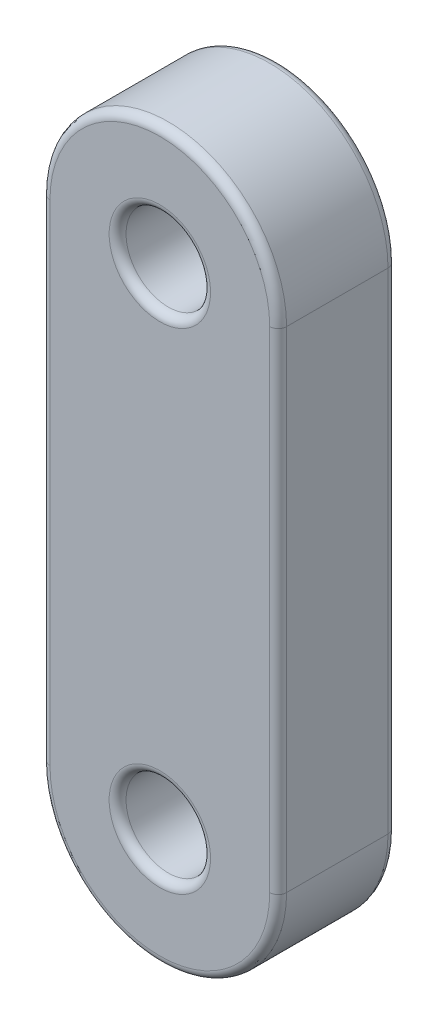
ISO-10303-21;
HEADER;
FILE_DESCRIPTION(('STEP AP214'),'2;1');
FILE_NAME('part.step','',(''),(''),'','','');
FILE_SCHEMA(('AUTOMOTIVE_DESIGN { 1 0 10303 214 1 1 1 1 }'));
ENDSEC;
DATA;
#1=APPLICATION_CONTEXT('core data for automotive mechanical design processes');
#2=APPLICATION_PROTOCOL_DEFINITION('international standard','automotive_design',2000,#1);
#3=PRODUCT_CONTEXT('',#1,'mechanical');
#4=PRODUCT('Part','Part','',(#3));
#5=PRODUCT_RELATED_PRODUCT_CATEGORY('part','',(#4));
#6=PRODUCT_DEFINITION_FORMATION('','',#4);
#7=PRODUCT_DEFINITION_CONTEXT('part definition',#1,'design');
#8=PRODUCT_DEFINITION('design','',#6,#7);
#9=PRODUCT_DEFINITION_SHAPE('','',#8);
#10=(LENGTH_UNIT() NAMED_UNIT(*) SI_UNIT(.MILLI.,.METRE.));
#11=(NAMED_UNIT(*) PLANE_ANGLE_UNIT() SI_UNIT($,.RADIAN.));
#12=(NAMED_UNIT(*) SI_UNIT($,.STERADIAN.) SOLID_ANGLE_UNIT());
#13=UNCERTAINTY_MEASURE_WITH_UNIT(LENGTH_MEASURE(1.E-05),#10,'distance_accuracy_value','');
#14=(GEOMETRIC_REPRESENTATION_CONTEXT(3) GLOBAL_UNCERTAINTY_ASSIGNED_CONTEXT((#13)) GLOBAL_UNIT_ASSIGNED_CONTEXT((#10,
#11,#12)) REPRESENTATION_CONTEXT('',''));
#15=CARTESIAN_POINT('',(0.,0.,0.));
#16=DIRECTION('',(0.,0.,1.));
#17=DIRECTION('',(1.,0.,0.));
#18=AXIS2_PLACEMENT_3D('',#15,#16,#17);
#19=CARTESIAN_POINT('',(0.,14.5,3.5));
#20=DIRECTION('',(0.,0.,1.));
#21=DIRECTION('',(1.,0.,0.));
#22=AXIS2_PLACEMENT_3D('',#19,#20,#21);
#23=PLANE('',#22);
#24=CARTESIAN_POINT('',(0.,-14.5,3.5));
#25=DIRECTION('',(0.,0.,1.));
#26=DIRECTION('',(1.,0.,0.));
#27=AXIS2_PLACEMENT_3D('',#24,#25,#26);
#28=CIRCLE('',#27,3.);
#29=CARTESIAN_POINT('',(3.,-14.5,3.5));
#30=VERTEX_POINT('',#29);
#31=EDGE_CURVE('E11',#30,#30,#28,.F.);
#32=ORIENTED_EDGE('',*,*,#31,.T.);
#33=EDGE_LOOP('',(#32));
#34=FACE_BOUND('',#33,.T.);
#35=CARTESIAN_POINT('',(0.,-14.5,3.5));
#36=DIRECTION('',(0.,0.,1.));
#37=DIRECTION('',(1.,0.,0.));
#38=AXIS2_PLACEMENT_3D('',#35,#36,#37);
#39=CIRCLE('',#38,6.5);
#40=CARTESIAN_POINT('',(-6.5,-14.5,3.5));
#41=VERTEX_POINT('',#40);
#42=CARTESIAN_POINT('',(6.5,-14.5,3.5));
#43=VERTEX_POINT('',#42);
#44=EDGE_CURVE('E47',#41,#43,#39,.T.);
#45=ORIENTED_EDGE('',*,*,#44,.T.);
#46=DIRECTION('',(0.,1.,0.));
#47=VECTOR('',#46,1.);
#48=CARTESIAN_POINT('',(6.5,14.5,3.5));
#49=LINE('',#48,#47);
#50=CARTESIAN_POINT('',(6.5,14.5,3.5));
#51=VERTEX_POINT('',#50);
#52=EDGE_CURVE('E39',#43,#51,#49,.T.);
#53=ORIENTED_EDGE('',*,*,#52,.T.);
#54=CARTESIAN_POINT('',(0.,14.5,3.5));
#55=DIRECTION('',(0.,0.,1.));
#56=DIRECTION('',(1.,0.,0.));
#57=AXIS2_PLACEMENT_3D('',#54,#55,#56);
#58=CIRCLE('',#57,6.5);
#59=CARTESIAN_POINT('',(-6.5,14.5,3.5));
#60=VERTEX_POINT('',#59);
#61=EDGE_CURVE('E163',#51,#60,#58,.T.);
#62=ORIENTED_EDGE('',*,*,#61,.T.);
#63=DIRECTION('',(0.,-1.,0.));
#64=VECTOR('',#63,1.);
#65=CARTESIAN_POINT('',(-6.5,-14.5,3.5));
#66=LINE('',#65,#64);
#67=EDGE_CURVE('E52',#60,#41,#66,.T.);
#68=ORIENTED_EDGE('',*,*,#67,.T.);
#69=EDGE_LOOP('',(#45,#53,#62,#68));
#70=FACE_BOUND('',#69,.T.);
#71=CARTESIAN_POINT('',(0.,14.5,3.5));
#72=DIRECTION('',(0.,0.,1.));
#73=DIRECTION('',(1.,0.,0.));
#74=AXIS2_PLACEMENT_3D('',#71,#72,#73);
#75=CIRCLE('',#74,3.);
#76=CARTESIAN_POINT('',(3.,14.5,3.5));
#77=VERTEX_POINT('',#76);
#78=EDGE_CURVE('E160',#77,#77,#75,.F.);
#79=ORIENTED_EDGE('',*,*,#78,.T.);
#80=EDGE_LOOP('',(#79));
#81=FACE_BOUND('',#80,.T.);
#82=ADVANCED_FACE('F30',(#34,#70,#81),#23,.T.);
#83=CARTESIAN_POINT('',(0.,14.5,-3.5));
#84=DIRECTION('',(0.,0.,1.));
#85=DIRECTION('',(1.,0.,0.));
#86=AXIS2_PLACEMENT_3D('',#83,#84,#85);
#87=PLANE('',#86);
#88=CARTESIAN_POINT('',(0.,-14.5,-3.5));
#89=DIRECTION('',(0.,0.,1.));
#90=DIRECTION('',(1.,0.,0.));
#91=AXIS2_PLACEMENT_3D('',#88,#89,#90);
#92=CIRCLE('',#91,3.);
#93=CARTESIAN_POINT('',(3.,-14.5,-3.5));
#94=VERTEX_POINT('',#93);
#95=EDGE_CURVE('E125',#94,#94,#92,.T.);
#96=ORIENTED_EDGE('',*,*,#95,.T.);
#97=EDGE_LOOP('',(#96));
#98=FACE_BOUND('',#97,.T.);
#99=CARTESIAN_POINT('',(0.,-14.5,-3.5));
#100=DIRECTION('',(0.,0.,1.));
#101=DIRECTION('',(1.,0.,0.));
#102=AXIS2_PLACEMENT_3D('',#99,#100,#101);
#103=CIRCLE('',#102,6.5);
#104=CARTESIAN_POINT('',(6.5,-14.5,-3.5));
#105=VERTEX_POINT('',#104);
#106=CARTESIAN_POINT('',(-6.5,-14.5,-3.5));
#107=VERTEX_POINT('',#106);
#108=EDGE_CURVE('E124',#105,#107,#103,.F.);
#109=ORIENTED_EDGE('',*,*,#108,.T.);
#110=DIRECTION('',(0.,-1.,0.));
#111=VECTOR('',#110,1.);
#112=CARTESIAN_POINT('',(-6.5,14.5,-3.5));
#113=LINE('',#112,#111);
#114=CARTESIAN_POINT('',(-6.5,14.5,-3.5));
#115=VERTEX_POINT('',#114);
#116=EDGE_CURVE('E102',#107,#115,#113,.F.);
#117=ORIENTED_EDGE('',*,*,#116,.T.);
#118=CARTESIAN_POINT('',(0.,14.5,-3.5));
#119=DIRECTION('',(0.,0.,1.));
#120=DIRECTION('',(1.,0.,0.));
#121=AXIS2_PLACEMENT_3D('',#118,#119,#120);
#122=CIRCLE('',#121,6.5);
#123=CARTESIAN_POINT('',(6.5,14.5,-3.5));
#124=VERTEX_POINT('',#123);
#125=EDGE_CURVE('E112',#115,#124,#122,.F.);
#126=ORIENTED_EDGE('',*,*,#125,.T.);
#127=DIRECTION('',(0.,1.,0.));
#128=VECTOR('',#127,1.);
#129=CARTESIAN_POINT('',(6.5,14.5,-3.5));
#130=LINE('',#129,#128);
#131=EDGE_CURVE('E118',#124,#105,#130,.F.);
#132=ORIENTED_EDGE('',*,*,#131,.T.);
#133=EDGE_LOOP('',(#109,#117,#126,#132));
#134=FACE_BOUND('',#133,.T.);
#135=CARTESIAN_POINT('',(0.,14.5,-3.5));
#136=DIRECTION('',(0.,0.,1.));
#137=DIRECTION('',(1.,0.,0.));
#138=AXIS2_PLACEMENT_3D('',#135,#136,#137);
#139=CIRCLE('',#138,3.);
#140=CARTESIAN_POINT('',(3.,14.5,-3.5));
#141=VERTEX_POINT('',#140);
#142=EDGE_CURVE('E119',#141,#141,#139,.T.);
#143=ORIENTED_EDGE('',*,*,#142,.T.);
#144=EDGE_LOOP('',(#143));
#145=FACE_BOUND('',#144,.T.);
#146=ADVANCED_FACE('F121',(#98,#134,#145),#87,.F.);
#147=CARTESIAN_POINT('',(0.,14.5,3.5));
#148=DIRECTION('',(0.,0.,-1.));
#149=DIRECTION('',(-1.,0.,0.));
#150=AXIS2_PLACEMENT_3D('',#147,#148,#149);
#151=CYLINDRICAL_SURFACE('',#150,7.);
#152=DIRECTION('',(0.,0.,-1.));
#153=VECTOR('',#152,1.);
#154=CARTESIAN_POINT('',(7.,14.5,3.5));
#155=LINE('',#154,#153);
#156=CARTESIAN_POINT('',(7.,14.5,3.));
#157=VERTEX_POINT('',#156);
#158=CARTESIAN_POINT('',(7.,14.5,-3.));
#159=VERTEX_POINT('',#158);
#160=EDGE_CURVE('E172',#157,#159,#155,.T.);
#161=ORIENTED_EDGE('',*,*,#160,.T.);
#162=CARTESIAN_POINT('',(0.,14.5,-3.));
#163=DIRECTION('',(0.,0.,1.));
#164=DIRECTION('',(1.,0.,0.));
#165=AXIS2_PLACEMENT_3D('',#162,#163,#164);
#166=CIRCLE('',#165,7.);
#167=CARTESIAN_POINT('',(-7.,14.5,-3.));
#168=VERTEX_POINT('',#167);
#169=EDGE_CURVE('E152',#159,#168,#166,.T.);
#170=ORIENTED_EDGE('',*,*,#169,.T.);
#171=DIRECTION('',(0.,0.,-1.));
#172=VECTOR('',#171,1.);
#173=CARTESIAN_POINT('',(-7.,14.5,3.5));
#174=LINE('',#173,#172);
#175=CARTESIAN_POINT('',(-7.,14.5,3.));
#176=VERTEX_POINT('',#175);
#177=EDGE_CURVE('E194',#176,#168,#174,.T.);
#178=ORIENTED_EDGE('',*,*,#177,.F.);
#179=CARTESIAN_POINT('',(0.,14.5,3.));
#180=DIRECTION('',(0.,0.,1.));
#181=DIRECTION('',(1.,0.,0.));
#182=AXIS2_PLACEMENT_3D('',#179,#180,#181);
#183=CIRCLE('',#182,7.);
#184=EDGE_CURVE('E150',#176,#157,#183,.F.);
#185=ORIENTED_EDGE('',*,*,#184,.T.);
#186=EDGE_LOOP('',(#161,#170,#178,#185));
#187=FACE_BOUND('',#186,.T.);
#188=ADVANCED_FACE('F199',(#187),#151,.T.);
#189=CARTESIAN_POINT('',(-7.,14.5,3.5));
#190=DIRECTION('',(1.,0.,0.));
#191=DIRECTION('',(0.,1.,0.));
#192=AXIS2_PLACEMENT_3D('',#189,#190,#191);
#193=PLANE('',#192);
#194=ORIENTED_EDGE('',*,*,#177,.T.);
#195=DIRECTION('',(0.,-1.,0.));
#196=VECTOR('',#195,1.);
#197=CARTESIAN_POINT('',(-7.,14.5,-3.));
#198=LINE('',#197,#196);
#199=CARTESIAN_POINT('',(-7.,-14.5,-3.));
#200=VERTEX_POINT('',#199);
#201=EDGE_CURVE('E105',#168,#200,#198,.T.);
#202=ORIENTED_EDGE('',*,*,#201,.T.);
#203=DIRECTION('',(0.,0.,-1.));
#204=VECTOR('',#203,1.);
#205=CARTESIAN_POINT('',(-7.,-14.5,3.5));
#206=LINE('',#205,#204);
#207=CARTESIAN_POINT('',(-7.,-14.5,3.));
#208=VERTEX_POINT('',#207);
#209=EDGE_CURVE('E196',#208,#200,#206,.T.);
#210=ORIENTED_EDGE('',*,*,#209,.F.);
#211=DIRECTION('',(0.,-1.,0.));
#212=VECTOR('',#211,1.);
#213=CARTESIAN_POINT('',(-7.,14.5,3.));
#214=LINE('',#213,#212);
#215=EDGE_CURVE('E138',#208,#176,#214,.F.);
#216=ORIENTED_EDGE('',*,*,#215,.T.);
#217=EDGE_LOOP('',(#194,#202,#210,#216));
#218=FACE_BOUND('',#217,.T.);
#219=ADVANCED_FACE('F193',(#218),#193,.F.);
#220=CARTESIAN_POINT('',(0.,-14.5,3.5));
#221=DIRECTION('',(0.,0.,-1.));
#222=DIRECTION('',(-1.,0.,0.));
#223=AXIS2_PLACEMENT_3D('',#220,#221,#222);
#224=CYLINDRICAL_SURFACE('',#223,7.);
#225=ORIENTED_EDGE('',*,*,#209,.T.);
#226=CARTESIAN_POINT('',(0.,-14.5,-3.));
#227=DIRECTION('',(0.,0.,1.));
#228=DIRECTION('',(1.,0.,0.));
#229=AXIS2_PLACEMENT_3D('',#226,#227,#228);
#230=CIRCLE('',#229,7.);
#231=CARTESIAN_POINT('',(7.,-14.5,-3.));
#232=VERTEX_POINT('',#231);
#233=EDGE_CURVE('E143',#200,#232,#230,.T.);
#234=ORIENTED_EDGE('',*,*,#233,.T.);
#235=DIRECTION('',(0.,0.,-1.));
#236=VECTOR('',#235,1.);
#237=CARTESIAN_POINT('',(7.,-14.5,3.5));
#238=LINE('',#237,#236);
#239=CARTESIAN_POINT('',(7.,-14.5,3.));
#240=VERTEX_POINT('',#239);
#241=EDGE_CURVE('E204',#240,#232,#238,.T.);
#242=ORIENTED_EDGE('',*,*,#241,.F.);
#243=CARTESIAN_POINT('',(0.,-14.5,3.));
#244=DIRECTION('',(0.,0.,1.));
#245=DIRECTION('',(1.,0.,0.));
#246=AXIS2_PLACEMENT_3D('',#243,#244,#245);
#247=CIRCLE('',#246,7.);
#248=EDGE_CURVE('E141',#240,#208,#247,.F.);
#249=ORIENTED_EDGE('',*,*,#248,.T.);
#250=EDGE_LOOP('',(#225,#234,#242,#249));
#251=FACE_BOUND('',#250,.T.);
#252=ADVANCED_FACE('F217',(#251),#224,.T.);
#253=CARTESIAN_POINT('',(7.,14.5,3.5));
#254=DIRECTION('',(-1.,0.,0.));
#255=DIRECTION('',(0.,-1.,0.));
#256=AXIS2_PLACEMENT_3D('',#253,#254,#255);
#257=PLANE('',#256);
#258=ORIENTED_EDGE('',*,*,#241,.T.);
#259=DIRECTION('',(0.,1.,0.));
#260=VECTOR('',#259,1.);
#261=CARTESIAN_POINT('',(7.,14.5,-3.));
#262=LINE('',#261,#260);
#263=EDGE_CURVE('E148',#232,#159,#262,.T.);
#264=ORIENTED_EDGE('',*,*,#263,.T.);
#265=ORIENTED_EDGE('',*,*,#160,.F.);
#266=DIRECTION('',(0.,1.,0.));
#267=VECTOR('',#266,1.);
#268=CARTESIAN_POINT('',(7.,-14.5,3.));
#269=LINE('',#268,#267);
#270=EDGE_CURVE('E145',#157,#240,#269,.F.);
#271=ORIENTED_EDGE('',*,*,#270,.T.);
#272=EDGE_LOOP('',(#258,#264,#265,#271));
#273=FACE_BOUND('',#272,.T.);
#274=ADVANCED_FACE('F221',(#273),#257,.F.);
#275=CARTESIAN_POINT('',(0.,14.5,3.5));
#276=DIRECTION('',(0.,0.,-1.));
#277=DIRECTION('',(-1.,0.,0.));
#278=AXIS2_PLACEMENT_3D('',#275,#276,#277);
#279=CYLINDRICAL_SURFACE('',#278,2.5);
#280=CARTESIAN_POINT('',(0.,14.5,-3.));
#281=DIRECTION('',(0.,0.,1.));
#282=DIRECTION('',(1.,0.,0.));
#283=AXIS2_PLACEMENT_3D('',#280,#281,#282);
#284=CIRCLE('',#283,2.5);
#285=CARTESIAN_POINT('',(2.5,14.5,-3.));
#286=VERTEX_POINT('',#285);
#287=EDGE_CURVE('E157',#286,#286,#284,.F.);
#288=ORIENTED_EDGE('',*,*,#287,.T.);
#289=EDGE_LOOP('',(#288));
#290=FACE_BOUND('',#289,.T.);
#291=CARTESIAN_POINT('',(0.,14.5,3.));
#292=DIRECTION('',(0.,0.,1.));
#293=DIRECTION('',(1.,0.,0.));
#294=AXIS2_PLACEMENT_3D('',#291,#292,#293);
#295=CIRCLE('',#294,2.5);
#296=CARTESIAN_POINT('',(2.5,14.5,3.));
#297=VERTEX_POINT('',#296);
#298=EDGE_CURVE('E154',#297,#297,#295,.T.);
#299=ORIENTED_EDGE('',*,*,#298,.T.);
#300=EDGE_LOOP('',(#299));
#301=FACE_BOUND('',#300,.T.);
#302=ADVANCED_FACE('F237',(#290,#301),#279,.F.);
#303=CARTESIAN_POINT('',(0.,-14.5,3.5));
#304=DIRECTION('',(0.,0.,-1.));
#305=DIRECTION('',(-1.,0.,0.));
#306=AXIS2_PLACEMENT_3D('',#303,#304,#305);
#307=CYLINDRICAL_SURFACE('',#306,2.5);
#308=CARTESIAN_POINT('',(0.,-14.5,-3.));
#309=DIRECTION('',(0.,0.,1.));
#310=DIRECTION('',(1.,0.,0.));
#311=AXIS2_PLACEMENT_3D('',#308,#309,#310);
#312=CIRCLE('',#311,2.5);
#313=CARTESIAN_POINT('',(2.5,-14.5,-3.));
#314=VERTEX_POINT('',#313);
#315=EDGE_CURVE('E135',#314,#314,#312,.F.);
#316=ORIENTED_EDGE('',*,*,#315,.T.);
#317=EDGE_LOOP('',(#316));
#318=FACE_BOUND('',#317,.T.);
#319=CARTESIAN_POINT('',(0.,-14.5,3.));
#320=DIRECTION('',(0.,0.,1.));
#321=DIRECTION('',(1.,0.,0.));
#322=AXIS2_PLACEMENT_3D('',#319,#320,#321);
#323=CIRCLE('',#322,2.5);
#324=CARTESIAN_POINT('',(2.5,-14.5,3.));
#325=VERTEX_POINT('',#324);
#326=EDGE_CURVE('E128',#325,#325,#323,.T.);
#327=ORIENTED_EDGE('',*,*,#326,.T.);
#328=EDGE_LOOP('',(#327));
#329=FACE_BOUND('',#328,.T.);
#330=ADVANCED_FACE('F239',(#318,#329),#307,.F.);
#331=CARTESIAN_POINT('',(0.,-14.5,-3.));
#332=DIRECTION('',(0.,0.,1.));
#333=DIRECTION('',(1.,0.,0.));
#334=AXIS2_PLACEMENT_3D('',#331,#332,#333);
#335=TOROIDAL_SURFACE('',#334,3.,0.5);
#336=ORIENTED_EDGE('',*,*,#315,.F.);
#337=EDGE_LOOP('',(#336));
#338=FACE_BOUND('',#337,.T.);
#339=ORIENTED_EDGE('',*,*,#95,.F.);
#340=EDGE_LOOP('',(#339));
#341=FACE_BOUND('',#340,.T.);
#342=ADVANCED_FACE('F246',(#338,#341),#335,.T.);
#343=CARTESIAN_POINT('',(6.5,14.5,-3.));
#344=DIRECTION('',(0.,1.,0.));
#345=DIRECTION('',(-1.,0.,0.));
#346=AXIS2_PLACEMENT_3D('',#343,#344,#345);
#347=CYLINDRICAL_SURFACE('',#346,0.5);
#348=CARTESIAN_POINT('',(6.5,-14.5,-3.));
#349=DIRECTION('',(0.,-1.,0.));
#350=DIRECTION('',(0.,0.,-1.));
#351=AXIS2_PLACEMENT_3D('',#348,#349,#350);
#352=CIRCLE('',#351,0.5);
#353=EDGE_CURVE('E108',#105,#232,#352,.T.);
#354=ORIENTED_EDGE('',*,*,#353,.F.);
#355=ORIENTED_EDGE('',*,*,#131,.F.);
#356=CARTESIAN_POINT('',(6.5,14.5,-3.));
#357=DIRECTION('',(0.,1.,0.));
#358=DIRECTION('',(0.,0.,1.));
#359=AXIS2_PLACEMENT_3D('',#356,#357,#358);
#360=CIRCLE('',#359,0.5);
#361=EDGE_CURVE('E115',#159,#124,#360,.T.);
#362=ORIENTED_EDGE('',*,*,#361,.F.);
#363=ORIENTED_EDGE('',*,*,#263,.F.);
#364=EDGE_LOOP('',(#354,#355,#362,#363));
#365=FACE_BOUND('',#364,.T.);
#366=ADVANCED_FACE('F210',(#365),#347,.T.);
#367=CARTESIAN_POINT('',(0.,14.5,-3.));
#368=DIRECTION('',(0.,0.,1.));
#369=DIRECTION('',(1.,0.,0.));
#370=AXIS2_PLACEMENT_3D('',#367,#368,#369);
#371=TOROIDAL_SURFACE('',#370,6.5,0.5);
#372=ORIENTED_EDGE('',*,*,#361,.T.);
#373=ORIENTED_EDGE('',*,*,#125,.F.);
#374=CARTESIAN_POINT('',(-6.5,14.5,-3.));
#375=DIRECTION('',(0.,-1.,0.));
#376=DIRECTION('',(0.,0.,-1.));
#377=AXIS2_PLACEMENT_3D('',#374,#375,#376);
#378=CIRCLE('',#377,0.5);
#379=EDGE_CURVE('E98',#168,#115,#378,.T.);
#380=ORIENTED_EDGE('',*,*,#379,.F.);
#381=ORIENTED_EDGE('',*,*,#169,.F.);
#382=EDGE_LOOP('',(#372,#373,#380,#381));
#383=FACE_BOUND('',#382,.T.);
#384=ADVANCED_FACE('F113',(#383),#371,.T.);
#385=CARTESIAN_POINT('',(0.,-14.5,-3.));
#386=DIRECTION('',(0.,0.,1.));
#387=DIRECTION('',(1.,0.,0.));
#388=AXIS2_PLACEMENT_3D('',#385,#386,#387);
#389=TOROIDAL_SURFACE('',#388,6.5,0.5);
#390=ORIENTED_EDGE('',*,*,#353,.T.);
#391=ORIENTED_EDGE('',*,*,#233,.F.);
#392=CARTESIAN_POINT('',(-6.5,-14.5,-3.));
#393=DIRECTION('',(0.,1.,0.));
#394=DIRECTION('',(0.,0.,1.));
#395=AXIS2_PLACEMENT_3D('',#392,#393,#394);
#396=CIRCLE('',#395,0.5);
#397=EDGE_CURVE('E109',#107,#200,#396,.T.);
#398=ORIENTED_EDGE('',*,*,#397,.F.);
#399=ORIENTED_EDGE('',*,*,#108,.F.);
#400=EDGE_LOOP('',(#390,#391,#398,#399));
#401=FACE_BOUND('',#400,.T.);
#402=ADVANCED_FACE('F213',(#401),#389,.T.);
#403=CARTESIAN_POINT('',(-6.5,14.5,-3.));
#404=DIRECTION('',(0.,-1.,0.));
#405=DIRECTION('',(1.,0.,0.));
#406=AXIS2_PLACEMENT_3D('',#403,#404,#405);
#407=CYLINDRICAL_SURFACE('',#406,0.5);
#408=ORIENTED_EDGE('',*,*,#379,.T.);
#409=ORIENTED_EDGE('',*,*,#116,.F.);
#410=ORIENTED_EDGE('',*,*,#397,.T.);
#411=ORIENTED_EDGE('',*,*,#201,.F.);
#412=EDGE_LOOP('',(#408,#409,#410,#411));
#413=FACE_BOUND('',#412,.T.);
#414=ADVANCED_FACE('F100',(#413),#407,.T.);
#415=CARTESIAN_POINT('',(0.,14.5,-3.));
#416=DIRECTION('',(0.,0.,1.));
#417=DIRECTION('',(1.,0.,0.));
#418=AXIS2_PLACEMENT_3D('',#415,#416,#417);
#419=TOROIDAL_SURFACE('',#418,3.,0.5);
#420=ORIENTED_EDGE('',*,*,#287,.F.);
#421=EDGE_LOOP('',(#420));
#422=FACE_BOUND('',#421,.T.);
#423=ORIENTED_EDGE('',*,*,#142,.F.);
#424=EDGE_LOOP('',(#423));
#425=FACE_BOUND('',#424,.T.);
#426=ADVANCED_FACE('F265',(#422,#425),#419,.T.);
#427=CARTESIAN_POINT('',(0.,-14.5,3.));
#428=DIRECTION('',(0.,0.,1.));
#429=DIRECTION('',(1.,0.,0.));
#430=AXIS2_PLACEMENT_3D('',#427,#428,#429);
#431=TOROIDAL_SURFACE('',#430,3.,0.5);
#432=ORIENTED_EDGE('',*,*,#31,.F.);
#433=EDGE_LOOP('',(#432));
#434=FACE_BOUND('',#433,.T.);
#435=ORIENTED_EDGE('',*,*,#326,.F.);
#436=EDGE_LOOP('',(#435));
#437=FACE_BOUND('',#436,.T.);
#438=ADVANCED_FACE('F274',(#434,#437),#431,.T.);
#439=CARTESIAN_POINT('',(-6.5,14.5,3.));
#440=DIRECTION('',(0.,1.,0.));
#441=DIRECTION('',(-1.,0.,0.));
#442=AXIS2_PLACEMENT_3D('',#439,#440,#441);
#443=CYLINDRICAL_SURFACE('',#442,0.5);
#444=CARTESIAN_POINT('',(-6.5,14.5,3.));
#445=DIRECTION('',(0.,1.,0.));
#446=DIRECTION('',(0.,0.,1.));
#447=AXIS2_PLACEMENT_3D('',#444,#445,#446);
#448=CIRCLE('',#447,0.5);
#449=EDGE_CURVE('E176',#176,#60,#448,.T.);
#450=ORIENTED_EDGE('',*,*,#449,.F.);
#451=ORIENTED_EDGE('',*,*,#215,.F.);
#452=CARTESIAN_POINT('',(-6.5,-14.5,3.));
#453=DIRECTION('',(0.,-1.,0.));
#454=DIRECTION('',(0.,0.,-1.));
#455=AXIS2_PLACEMENT_3D('',#452,#453,#454);
#456=CIRCLE('',#455,0.5);
#457=EDGE_CURVE('E34',#41,#208,#456,.T.);
#458=ORIENTED_EDGE('',*,*,#457,.F.);
#459=ORIENTED_EDGE('',*,*,#67,.F.);
#460=EDGE_LOOP('',(#450,#451,#458,#459));
#461=FACE_BOUND('',#460,.T.);
#462=ADVANCED_FACE('F188',(#461),#443,.T.);
#463=CARTESIAN_POINT('',(0.,-14.5,3.));
#464=DIRECTION('',(0.,0.,1.));
#465=DIRECTION('',(1.,0.,0.));
#466=AXIS2_PLACEMENT_3D('',#463,#464,#465);
#467=TOROIDAL_SURFACE('',#466,6.5,0.5);
#468=ORIENTED_EDGE('',*,*,#457,.T.);
#469=ORIENTED_EDGE('',*,*,#248,.F.);
#470=CARTESIAN_POINT('',(6.5,-14.5,3.));
#471=DIRECTION('',(0.,1.,0.));
#472=DIRECTION('',(0.,0.,1.));
#473=AXIS2_PLACEMENT_3D('',#470,#471,#472);
#474=CIRCLE('',#473,0.5);
#475=EDGE_CURVE('E175',#43,#240,#474,.T.);
#476=ORIENTED_EDGE('',*,*,#475,.F.);
#477=ORIENTED_EDGE('',*,*,#44,.F.);
#478=EDGE_LOOP('',(#468,#469,#476,#477));
#479=FACE_BOUND('',#478,.T.);
#480=ADVANCED_FACE('F185',(#479),#467,.T.);
#481=CARTESIAN_POINT('',(0.,14.5,3.));
#482=DIRECTION('',(0.,0.,1.));
#483=DIRECTION('',(1.,0.,0.));
#484=AXIS2_PLACEMENT_3D('',#481,#482,#483);
#485=TOROIDAL_SURFACE('',#484,6.5,0.5);
#486=ORIENTED_EDGE('',*,*,#449,.T.);
#487=ORIENTED_EDGE('',*,*,#61,.F.);
#488=CARTESIAN_POINT('',(6.5,14.5,3.));
#489=DIRECTION('',(0.,-1.,0.));
#490=DIRECTION('',(0.,0.,-1.));
#491=AXIS2_PLACEMENT_3D('',#488,#489,#490);
#492=CIRCLE('',#491,0.5);
#493=EDGE_CURVE('E173',#157,#51,#492,.T.);
#494=ORIENTED_EDGE('',*,*,#493,.F.);
#495=ORIENTED_EDGE('',*,*,#184,.F.);
#496=EDGE_LOOP('',(#486,#487,#494,#495));
#497=FACE_BOUND('',#496,.T.);
#498=ADVANCED_FACE('F226',(#497),#485,.T.);
#499=CARTESIAN_POINT('',(6.5,14.5,3.));
#500=DIRECTION('',(0.,-1.,0.));
#501=DIRECTION('',(1.,0.,0.));
#502=AXIS2_PLACEMENT_3D('',#499,#500,#501);
#503=CYLINDRICAL_SURFACE('',#502,0.5);
#504=ORIENTED_EDGE('',*,*,#475,.T.);
#505=ORIENTED_EDGE('',*,*,#270,.F.);
#506=ORIENTED_EDGE('',*,*,#493,.T.);
#507=ORIENTED_EDGE('',*,*,#52,.F.);
#508=EDGE_LOOP('',(#504,#505,#506,#507));
#509=FACE_BOUND('',#508,.T.);
#510=ADVANCED_FACE('F224',(#509),#503,.T.);
#511=CARTESIAN_POINT('',(0.,14.5,3.));
#512=DIRECTION('',(0.,0.,1.));
#513=DIRECTION('',(1.,0.,0.));
#514=AXIS2_PLACEMENT_3D('',#511,#512,#513);
#515=TOROIDAL_SURFACE('',#514,3.,0.5);
#516=ORIENTED_EDGE('',*,*,#78,.F.);
#517=EDGE_LOOP('',(#516));
#518=FACE_BOUND('',#517,.T.);
#519=ORIENTED_EDGE('',*,*,#298,.F.);
#520=EDGE_LOOP('',(#519));
#521=FACE_BOUND('',#520,.T.);
#522=ADVANCED_FACE('F32',(#518,#521),#515,.T.);
#523=CLOSED_SHELL('',(#82,#146,#188,#219,#252,#274,#302,#330,#342,#366,#384,#402,#414,#426,#438,
#462,#480,#498,#510,#522));
#524=MANIFOLD_SOLID_BREP('B2',#523);
#525=ADVANCED_BREP_SHAPE_REPRESENTATION('',(#18,#524),#14);
#526=SHAPE_DEFINITION_REPRESENTATION(#9,#525);
ENDSEC;
END-ISO-10303-21;
